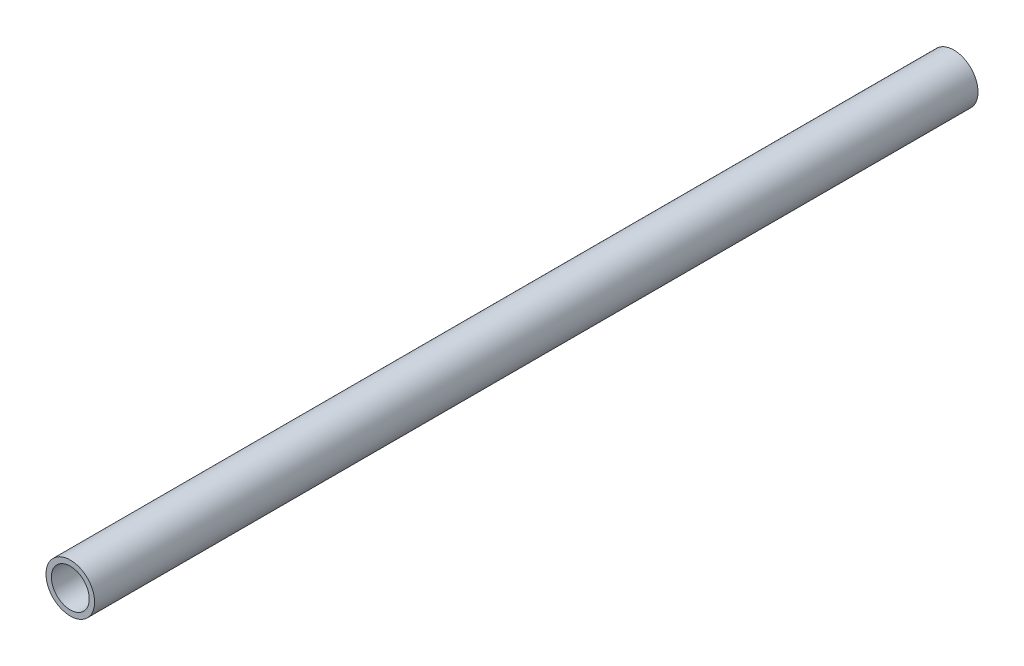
from build123d import *

# Parameters (mm, degrees)
SKETCH1_R          = 16.764
SKETCH1_R_2        = 13.081
BASE_EXTRUDE_DEPTH = 304.8


with BuildPart() as part:
    # Sketch1 → Base-Extrude (new, symmetric)
    with BuildSketch(Plane.XY):
        with Locations(Location((0, 0, 0), (0, 0, 180))):
            Circle(SKETCH1_R)
        with Locations(Location((0, 0, 0), (0, 0, 180))):
            Circle(SKETCH1_R_2, mode=Mode.SUBTRACT)
    extrude(amount=BASE_EXTRUDE_DEPTH, both=True)


solid = part.part
